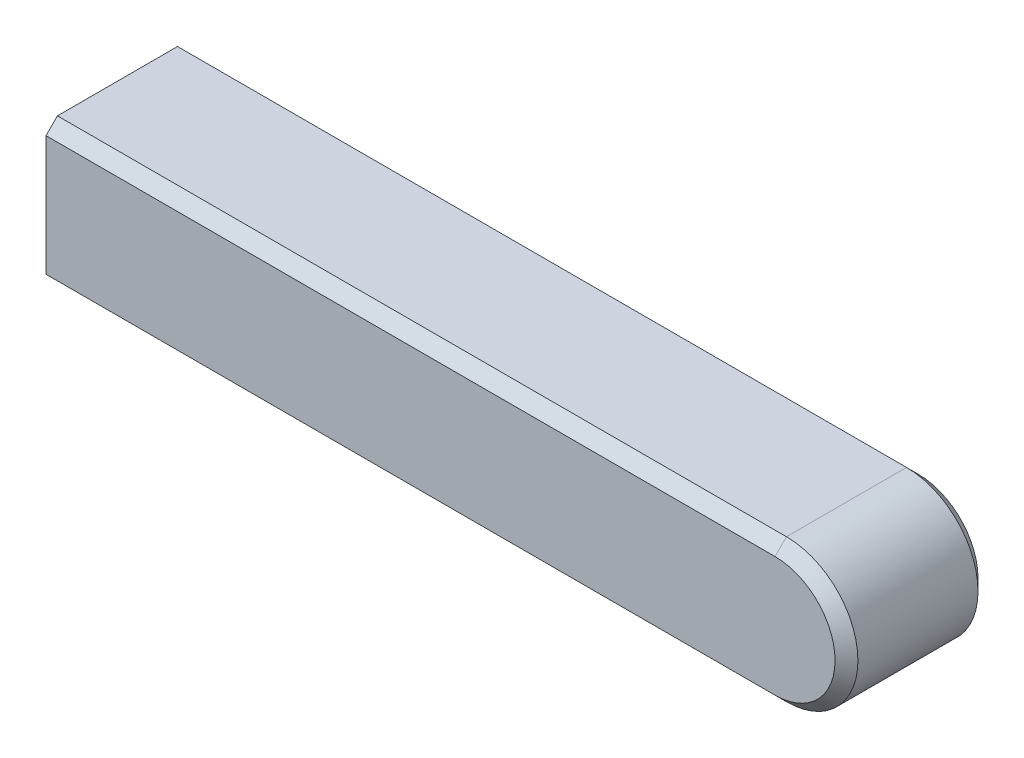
ISO-10303-21;
HEADER;
FILE_DESCRIPTION(('STEP AP214'),'2;1');
FILE_NAME('part.step','',(''),(''),'','','');
FILE_SCHEMA(('AUTOMOTIVE_DESIGN { 1 0 10303 214 1 1 1 1 }'));
ENDSEC;
DATA;
#1=APPLICATION_CONTEXT('core data for automotive mechanical design processes');
#2=APPLICATION_PROTOCOL_DEFINITION('international standard','automotive_design',2000,#1);
#3=PRODUCT_CONTEXT('',#1,'mechanical');
#4=PRODUCT('Part','Part','',(#3));
#5=PRODUCT_RELATED_PRODUCT_CATEGORY('part','',(#4));
#6=PRODUCT_DEFINITION_FORMATION('','',#4);
#7=PRODUCT_DEFINITION_CONTEXT('part definition',#1,'design');
#8=PRODUCT_DEFINITION('design','',#6,#7);
#9=PRODUCT_DEFINITION_SHAPE('','',#8);
#10=(LENGTH_UNIT() NAMED_UNIT(*) SI_UNIT(.MILLI.,.METRE.));
#11=(NAMED_UNIT(*) PLANE_ANGLE_UNIT() SI_UNIT($,.RADIAN.));
#12=(NAMED_UNIT(*) SI_UNIT($,.STERADIAN.) SOLID_ANGLE_UNIT());
#13=UNCERTAINTY_MEASURE_WITH_UNIT(LENGTH_MEASURE(1.E-05),#10,'distance_accuracy_value','');
#14=(GEOMETRIC_REPRESENTATION_CONTEXT(3) GLOBAL_UNCERTAINTY_ASSIGNED_CONTEXT((#13)) GLOBAL_UNIT_ASSIGNED_CONTEXT((#10,
#11,#12)) REPRESENTATION_CONTEXT('',''));
#15=CARTESIAN_POINT('',(0.,0.,0.));
#16=DIRECTION('',(0.,0.,1.));
#17=DIRECTION('',(1.,0.,0.));
#18=AXIS2_PLACEMENT_3D('',#15,#16,#17);
#19=CARTESIAN_POINT('',(33.6,-3.,0.4));
#20=DIRECTION('',(0.,-0.707106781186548,-0.707106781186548));
#21=DIRECTION('',(0.,0.707106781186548,-0.707106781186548));
#22=AXIS2_PLACEMENT_3D('',#19,#20,#21);
#23=PLANE('',#22);
#24=DIRECTION('',(1.,0.,0.));
#25=VECTOR('',#24,1.);
#26=CARTESIAN_POINT('',(0.,-3.,0.4));
#27=LINE('',#26,#25);
#28=CARTESIAN_POINT('',(0.,-3.,0.4));
#29=VERTEX_POINT('',#28);
#30=CARTESIAN_POINT('',(25.5,-3.00000000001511,0.400000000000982));
#31=VERTEX_POINT('',#30);
#32=EDGE_CURVE('E98',#29,#31,#27,.T.);
#33=ORIENTED_EDGE('',*,*,#32,.F.);
#34=DIRECTION('',(0.,0.707106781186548,-0.707106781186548));
#35=VECTOR('',#34,1.);
#36=CARTESIAN_POINT('',(0.,-3.,0.4));
#37=LINE('',#36,#35);
#38=CARTESIAN_POINT('',(0.,-2.6,0.));
#39=VERTEX_POINT('',#38);
#40=EDGE_CURVE('E70',#29,#39,#37,.T.);
#41=ORIENTED_EDGE('',*,*,#40,.T.);
#42=DIRECTION('',(1.,0.,0.));
#43=VECTOR('',#42,1.);
#44=CARTESIAN_POINT('',(0.,-2.6,0.));
#45=LINE('',#44,#43);
#46=CARTESIAN_POINT('',(25.5000001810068,-2.59999880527,0.));
#47=VERTEX_POINT('',#46);
#48=EDGE_CURVE('E46',#39,#47,#45,.T.);
#49=ORIENTED_EDGE('',*,*,#48,.T.);
#50=CARTESIAN_POINT('',(25.5,-3.00000000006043,0.400000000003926));
#51=CARTESIAN_POINT('',(25.5000000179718,-2.98333328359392,0.383333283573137));
#52=CARTESIAN_POINT('',(25.5000000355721,-2.96666656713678,0.366666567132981));
#53=CARTESIAN_POINT('',(25.5000000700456,-2.93333313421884,0.333333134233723));
#54=CARTESIAN_POINT('',(25.5000000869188,-2.91666641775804,0.31666641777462));
#55=CARTESIAN_POINT('',(25.5000001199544,-2.88333298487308,0.283332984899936));
#56=CARTESIAN_POINT('',(25.5000001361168,-2.86666626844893,0.266666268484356));
#57=CARTESIAN_POINT('',(25.5000001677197,-2.83333283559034,0.233332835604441));
#58=CARTESIAN_POINT('',(25.5000001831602,-2.81666611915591,0.216666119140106));
#59=CARTESIAN_POINT('',(25.5000002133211,-2.78333268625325,0.183332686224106));
#60=CARTESIAN_POINT('',(25.5000002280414,-2.76666596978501,0.16666596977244));
#61=CARTESIAN_POINT('',(25.5000002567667,-2.73333253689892,0.133332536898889));
#62=CARTESIAN_POINT('',(25.5000002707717,-2.71666582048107,0.116665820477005));
#63=CARTESIAN_POINT('',(25.5000002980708,-2.68333238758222,0.0833323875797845));
#64=CARTESIAN_POINT('',(25.5000003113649,-2.66666567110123,0.0666656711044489));
#65=CARTESIAN_POINT('',(25.500000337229,-2.63333223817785,0.0333322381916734));
#66=CARTESIAN_POINT('',(25.500000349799,-2.61666552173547,0.0166655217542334));
#67=CARTESIAN_POINT('',(25.5000003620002,-2.59999880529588,-1.19468599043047E-06));
#68=B_SPLINE_CURVE_WITH_KNOTS('',3,(#50,#51,#52,#53,#54,#55,#56,#57,#58,#59,#60,#61,#62,#63,#64,
#65,#66,#67),.UNSPECIFIED.,.F.,.F.,(4,2,2,2,2,2,2,2,4),(0.,0.0707108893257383,0.141421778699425,
0.212132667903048,0.282843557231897,0.35355444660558,0.424265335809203,0.494976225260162,
0.565687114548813),.UNSPECIFIED.);
#69=EDGE_CURVE('E57',#31,#47,#68,.T.);
#70=ORIENTED_EDGE('',*,*,#69,.F.);
#71=EDGE_LOOP('',(#33,#41,#49,#70));
#72=FACE_BOUND('',#71,.T.);
#73=ADVANCED_FACE('F16',(#72),#23,.T.);
#74=CARTESIAN_POINT('',(25.5000000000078,-0.500000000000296,0.400000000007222));
#75=DIRECTION('',(3.12634674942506E-12,-1.31831570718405E-12,1.));
#76=DIRECTION('',(1.,0.,-3.12634674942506E-12));
#77=AXIS2_PLACEMENT_3D('',#74,#75,#76);
#78=CONICAL_SURFACE('',#77,2.50000000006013,0.785398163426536);
#79=DIRECTION('',(0.,0.707106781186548,0.707106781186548));
#80=VECTOR('',#79,1.);
#81=CARTESIAN_POINT('',(25.5,2.,0.4));
#82=LINE('',#81,#80);
#83=CARTESIAN_POINT('',(25.5,2.,0.4));
#84=VERTEX_POINT('',#83);
#85=CARTESIAN_POINT('',(25.5000000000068,1.6,0.));
#86=VERTEX_POINT('',#85);
#87=EDGE_CURVE('E92',#84,#86,#82,.F.);
#88=ORIENTED_EDGE('',*,*,#87,.F.);
#89=CARTESIAN_POINT('',(25.5,-0.5,0.4));
#90=DIRECTION('',(0.,0.,1.));
#91=DIRECTION('',(1.,0.,0.));
#92=AXIS2_PLACEMENT_3D('',#89,#90,#91);
#93=CIRCLE('',#92,2.5);
#94=EDGE_CURVE('E175',#31,#84,#93,.T.);
#95=ORIENTED_EDGE('',*,*,#94,.F.);
#96=ORIENTED_EDGE('',*,*,#69,.T.);
#97=CARTESIAN_POINT('',(25.5000000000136,-0.500000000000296,0.));
#98=DIRECTION('',(0.,0.,1.));
#99=DIRECTION('',(1.,0.,0.));
#100=AXIS2_PLACEMENT_3D('',#97,#98,#99);
#101=CIRCLE('',#100,2.10000000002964);
#102=EDGE_CURVE('E19',#47,#86,#101,.T.);
#103=ORIENTED_EDGE('',*,*,#102,.T.);
#104=EDGE_LOOP('',(#88,#95,#96,#103));
#105=FACE_BOUND('',#104,.T.);
#106=ADVANCED_FACE('F214',(#105),#78,.T.);
#107=CARTESIAN_POINT('',(-5.6,2.,0.4));
#108=DIRECTION('',(0.,0.707106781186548,-0.707106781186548));
#109=DIRECTION('',(0.,0.707106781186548,0.707106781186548));
#110=AXIS2_PLACEMENT_3D('',#107,#108,#109);
#111=PLANE('',#110);
#112=DIRECTION('',(1.,0.,0.));
#113=VECTOR('',#112,1.);
#114=CARTESIAN_POINT('',(0.,1.6,0.));
#115=LINE('',#114,#113);
#116=CARTESIAN_POINT('',(0.,1.6,0.));
#117=VERTEX_POINT('',#116);
#118=EDGE_CURVE('E95',#86,#117,#115,.F.);
#119=ORIENTED_EDGE('',*,*,#118,.T.);
#120=DIRECTION('',(0.,0.707106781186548,0.707106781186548));
#121=VECTOR('',#120,1.);
#122=CARTESIAN_POINT('',(0.,2.,0.4));
#123=LINE('',#122,#121);
#124=CARTESIAN_POINT('',(0.,2.,0.4));
#125=VERTEX_POINT('',#124);
#126=EDGE_CURVE('E78',#117,#125,#123,.T.);
#127=ORIENTED_EDGE('',*,*,#126,.T.);
#128=DIRECTION('',(1.,0.,0.));
#129=VECTOR('',#128,1.);
#130=CARTESIAN_POINT('',(25.5,2.,0.4));
#131=LINE('',#130,#129);
#132=EDGE_CURVE('E102',#84,#125,#131,.F.);
#133=ORIENTED_EDGE('',*,*,#132,.F.);
#134=ORIENTED_EDGE('',*,*,#87,.T.);
#135=EDGE_LOOP('',(#119,#127,#133,#134));
#136=FACE_BOUND('',#135,.T.);
#137=ADVANCED_FACE('F96',(#136),#111,.T.);
#138=CARTESIAN_POINT('',(0.,0.,0.));
#139=DIRECTION('',(0.,0.,1.));
#140=DIRECTION('',(1.,0.,0.));
#141=AXIS2_PLACEMENT_3D('',#138,#139,#140);
#142=PLANE('',#141);
#143=ORIENTED_EDGE('',*,*,#102,.F.);
#144=ORIENTED_EDGE('',*,*,#48,.F.);
#145=DIRECTION('',(0.,1.,0.));
#146=VECTOR('',#145,1.);
#147=CARTESIAN_POINT('',(0.,2.,0.));
#148=LINE('',#147,#146);
#149=EDGE_CURVE('E88',#117,#39,#148,.F.);
#150=ORIENTED_EDGE('',*,*,#149,.F.);
#151=ORIENTED_EDGE('',*,*,#118,.F.);
#152=EDGE_LOOP('',(#143,#144,#150,#151));
#153=FACE_BOUND('',#152,.T.);
#154=ADVANCED_FACE('F100',(#153),#142,.F.);
#155=CARTESIAN_POINT('',(0.,-3.,0.));
#156=DIRECTION('',(0.,-1.,0.));
#157=DIRECTION('',(0.,0.,-1.));
#158=AXIS2_PLACEMENT_3D('',#155,#156,#157);
#159=PLANE('',#158);
#160=DIRECTION('',(0.,0.,1.));
#161=VECTOR('',#160,1.);
#162=CARTESIAN_POINT('',(0.,-3.,0.));
#163=LINE('',#162,#161);
#164=CARTESIAN_POINT('',(0.,-3.,4.6));
#165=VERTEX_POINT('',#164);
#166=EDGE_CURVE('E101',#29,#165,#163,.T.);
#167=ORIENTED_EDGE('',*,*,#166,.F.);
#168=ORIENTED_EDGE('',*,*,#32,.T.);
#169=DIRECTION('',(0.,0.,1.));
#170=VECTOR('',#169,1.);
#171=CARTESIAN_POINT('',(25.5,-3.,2.5));
#172=LINE('',#171,#170);
#173=CARTESIAN_POINT('',(25.5000000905,-3.00000000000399,4.60000000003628));
#174=VERTEX_POINT('',#173);
#175=EDGE_CURVE('E178',#174,#31,#172,.F.);
#176=ORIENTED_EDGE('',*,*,#175,.F.);
#177=DIRECTION('',(1.,0.,0.));
#178=VECTOR('',#177,1.);
#179=CARTESIAN_POINT('',(33.6,-3.,4.6));
#180=LINE('',#179,#178);
#181=EDGE_CURVE('E159',#174,#165,#180,.F.);
#182=ORIENTED_EDGE('',*,*,#181,.T.);
#183=EDGE_LOOP('',(#167,#168,#176,#182));
#184=FACE_BOUND('',#183,.T.);
#185=ADVANCED_FACE('F232',(#184),#159,.T.);
#186=CARTESIAN_POINT('',(25.5,-0.5,2.5));
#187=DIRECTION('',(0.,0.,1.));
#188=DIRECTION('',(1.,0.,0.));
#189=AXIS2_PLACEMENT_3D('',#186,#187,#188);
#190=CYLINDRICAL_SURFACE('',#189,2.5);
#191=ORIENTED_EDGE('',*,*,#175,.T.);
#192=ORIENTED_EDGE('',*,*,#94,.T.);
#193=DIRECTION('',(0.,0.,1.));
#194=VECTOR('',#193,1.);
#195=CARTESIAN_POINT('',(25.5,2.,0.));
#196=LINE('',#195,#194);
#197=CARTESIAN_POINT('',(25.5,2.00000000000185,4.60000000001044));
#198=VERTEX_POINT('',#197);
#199=EDGE_CURVE('E105',#198,#84,#196,.F.);
#200=ORIENTED_EDGE('',*,*,#199,.F.);
#201=CARTESIAN_POINT('',(25.5000000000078,-0.500000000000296,4.60000000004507));
#202=DIRECTION('',(3.12638803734E-12,-1.31838984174E-12,-1.));
#203=DIRECTION('',(-0.385834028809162,0.922568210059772,-2.42236786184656E-12));
#204=AXIS2_PLACEMENT_3D('',#201,#202,#203);
#205=CIRCLE('',#204,2.50000000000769);
#206=EDGE_CURVE('E167',#174,#198,#205,.F.);
#207=ORIENTED_EDGE('',*,*,#206,.F.);
#208=EDGE_LOOP('',(#191,#192,#200,#207));
#209=FACE_BOUND('',#208,.T.);
#210=ADVANCED_FACE('F227',(#209),#190,.T.);
#211=CARTESIAN_POINT('',(25.5,2.,0.));
#212=DIRECTION('',(0.,1.,0.));
#213=DIRECTION('',(0.,0.,1.));
#214=AXIS2_PLACEMENT_3D('',#211,#212,#213);
#215=PLANE('',#214);
#216=ORIENTED_EDGE('',*,*,#199,.T.);
#217=ORIENTED_EDGE('',*,*,#132,.T.);
#218=DIRECTION('',(0.,0.,1.));
#219=VECTOR('',#218,1.);
#220=CARTESIAN_POINT('',(0.,2.,0.));
#221=LINE('',#220,#219);
#222=CARTESIAN_POINT('',(0.,2.,4.6));
#223=VERTEX_POINT('',#222);
#224=EDGE_CURVE('E91',#223,#125,#221,.F.);
#225=ORIENTED_EDGE('',*,*,#224,.F.);
#226=DIRECTION('',(1.,0.,0.));
#227=VECTOR('',#226,1.);
#228=CARTESIAN_POINT('',(-5.6,2.,4.6));
#229=LINE('',#228,#227);
#230=EDGE_CURVE('E128',#223,#198,#229,.T.);
#231=ORIENTED_EDGE('',*,*,#230,.T.);
#232=EDGE_LOOP('',(#216,#217,#225,#231));
#233=FACE_BOUND('',#232,.T.);
#234=ADVANCED_FACE('F246',(#233),#215,.T.);
#235=CARTESIAN_POINT('',(0.,2.,0.));
#236=DIRECTION('',(-1.,0.,0.));
#237=DIRECTION('',(0.,0.,1.));
#238=AXIS2_PLACEMENT_3D('',#235,#236,#237);
#239=PLANE('',#238);
#240=ORIENTED_EDGE('',*,*,#224,.T.);
#241=ORIENTED_EDGE('',*,*,#126,.F.);
#242=ORIENTED_EDGE('',*,*,#149,.T.);
#243=ORIENTED_EDGE('',*,*,#40,.F.);
#244=ORIENTED_EDGE('',*,*,#166,.T.);
#245=DIRECTION('',(0.,0.707106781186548,0.707106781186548));
#246=VECTOR('',#245,1.);
#247=CARTESIAN_POINT('',(0.,-3.,4.6));
#248=LINE('',#247,#246);
#249=CARTESIAN_POINT('',(0.,-2.6,5.));
#250=VERTEX_POINT('',#249);
#251=EDGE_CURVE('E151',#165,#250,#248,.T.);
#252=ORIENTED_EDGE('',*,*,#251,.T.);
#253=DIRECTION('',(0.,1.,0.));
#254=VECTOR('',#253,1.);
#255=CARTESIAN_POINT('',(0.,0.,5.));
#256=LINE('',#255,#254);
#257=CARTESIAN_POINT('',(0.,1.6,5.));
#258=VERTEX_POINT('',#257);
#259=EDGE_CURVE('E116',#258,#250,#256,.F.);
#260=ORIENTED_EDGE('',*,*,#259,.F.);
#261=DIRECTION('',(0.,0.707106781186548,-0.707106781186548));
#262=VECTOR('',#261,1.);
#263=CARTESIAN_POINT('',(0.,2.,4.6));
#264=LINE('',#263,#262);
#265=EDGE_CURVE('E120',#258,#223,#264,.T.);
#266=ORIENTED_EDGE('',*,*,#265,.T.);
#267=EDGE_LOOP('',(#240,#241,#242,#243,#244,#252,#260,#266));
#268=FACE_BOUND('',#267,.T.);
#269=ADVANCED_FACE('F86',(#268),#239,.T.);
#270=CARTESIAN_POINT('',(33.6,-3.,4.6));
#271=DIRECTION('',(0.,0.707106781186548,-0.707106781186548));
#272=DIRECTION('',(0.,0.707106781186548,0.707106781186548));
#273=AXIS2_PLACEMENT_3D('',#270,#271,#272);
#274=PLANE('',#273);
#275=ORIENTED_EDGE('',*,*,#181,.F.);
#276=CARTESIAN_POINT('',(25.5000003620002,-2.59999880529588,5.00000119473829));
#277=CARTESIAN_POINT('',(25.5000003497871,-2.61666552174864,4.98333447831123));
#278=CARTESIAN_POINT('',(25.50000033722,-2.63333223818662,4.96666776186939));
#279=CARTESIAN_POINT('',(25.5000003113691,-2.66666567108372,4.93333432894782));
#280=CARTESIAN_POINT('',(25.5000002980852,-2.68333238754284,4.91666761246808));
#281=CARTESIAN_POINT('',(25.5000002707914,-2.71666582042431,4.88333417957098));
#282=CARTESIAN_POINT('',(25.5000002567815,-2.73333253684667,4.8666674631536));
#283=CARTESIAN_POINT('',(25.5000002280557,-2.76666596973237,4.83333403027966));
#284=CARTESIAN_POINT('',(25.5000002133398,-2.78333268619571,4.8166673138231));
#285=CARTESIAN_POINT('',(25.5000001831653,-2.81666611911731,4.78333388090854));
#286=CARTESIAN_POINT('',(25.5000001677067,-2.83333283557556,4.76666716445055));
#287=CARTESIAN_POINT('',(25.5000001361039,-2.86666626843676,4.7333337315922));
#288=CARTESIAN_POINT('',(25.5000001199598,-2.8833329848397,4.71666701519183));
#289=CARTESIAN_POINT('',(25.5000000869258,-2.91666641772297,4.68333358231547));
#290=CARTESIAN_POINT('',(25.500000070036,-2.9333331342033,4.66666686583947));
#291=CARTESIAN_POINT('',(25.500000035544,-2.96666656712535,4.63333343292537));
#292=CARTESIAN_POINT('',(25.5000000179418,-2.98333328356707,4.61666671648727));
#293=CARTESIAN_POINT('',(25.5,-3.00000000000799,4.60000000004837));
#294=B_SPLINE_CURVE_WITH_KNOTS('',3,(#276,#277,#278,#279,#280,#281,#282,#283,#284,#285,#286,
#287,#288,#289,#290,#291,#292,#293),.UNSPECIFIED.,.F.,.F.,(4,2,2,2,2,2,2,2,4),(0.,
0.0707108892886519,0.14142177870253,0.212132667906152,0.282843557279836,0.353554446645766,
0.424265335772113,0.494976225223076,0.565687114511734),.UNSPECIFIED.);
#295=CARTESIAN_POINT('',(25.5000001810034,-2.59999940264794,5.00000059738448));
#296=VERTEX_POINT('',#295);
#297=EDGE_CURVE('E138',#296,#174,#294,.T.);
#298=ORIENTED_EDGE('',*,*,#297,.F.);
#299=DIRECTION('',(1.,0.,0.));
#300=VECTOR('',#299,1.);
#301=CARTESIAN_POINT('',(0.,-2.6,5.));
#302=LINE('',#301,#300);
#303=EDGE_CURVE('E113',#250,#296,#302,.T.);
#304=ORIENTED_EDGE('',*,*,#303,.F.);
#305=ORIENTED_EDGE('',*,*,#251,.F.);
#306=EDGE_LOOP('',(#275,#298,#304,#305));
#307=FACE_BOUND('',#306,.T.);
#308=ADVANCED_FACE('F236',(#307),#274,.F.);
#309=CARTESIAN_POINT('',(25.5000000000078,-0.500000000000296,4.60000000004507));
#310=DIRECTION('',(3.12644768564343E-12,-1.31833225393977E-12,-1.));
#311=DIRECTION('',(-1.,0.,-3.12644768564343E-12));
#312=AXIS2_PLACEMENT_3D('',#309,#310,#311);
#313=CONICAL_SURFACE('',#312,2.50000000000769,0.785398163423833);
#314=DIRECTION('',(0.,0.707106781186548,-0.707106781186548));
#315=VECTOR('',#314,1.);
#316=CARTESIAN_POINT('',(25.5,2.,4.6));
#317=LINE('',#316,#315);
#318=CARTESIAN_POINT('',(25.5,1.59999999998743,5.00000000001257));
#319=VERTEX_POINT('',#318);
#320=EDGE_CURVE('E34',#198,#319,#317,.F.);
#321=ORIENTED_EDGE('',*,*,#320,.T.);
#322=CARTESIAN_POINT('',(25.5000000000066,-0.499999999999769,5.0000000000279));
#323=DIRECTION('',(3.12644768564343E-12,-1.31833225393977E-12,-1.));
#324=DIRECTION('',(-1.,0.,-3.12644768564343E-12));
#325=AXIS2_PLACEMENT_3D('',#322,#323,#324);
#326=CIRCLE('',#325,2.10000000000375);
#327=EDGE_CURVE('E25',#296,#319,#326,.F.);
#328=ORIENTED_EDGE('',*,*,#327,.F.);
#329=ORIENTED_EDGE('',*,*,#297,.T.);
#330=ORIENTED_EDGE('',*,*,#206,.T.);
#331=EDGE_LOOP('',(#321,#328,#329,#330));
#332=FACE_BOUND('',#331,.T.);
#333=ADVANCED_FACE('F146',(#332),#313,.T.);
#334=CARTESIAN_POINT('',(-5.6,2.,4.6));
#335=DIRECTION('',(0.,-0.707106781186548,-0.707106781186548));
#336=DIRECTION('',(0.,0.707106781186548,-0.707106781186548));
#337=AXIS2_PLACEMENT_3D('',#334,#335,#336);
#338=PLANE('',#337);
#339=DIRECTION('',(1.,0.,0.));
#340=VECTOR('',#339,1.);
#341=CARTESIAN_POINT('',(0.,1.6,5.));
#342=LINE('',#341,#340);
#343=EDGE_CURVE('E11',#319,#258,#342,.F.);
#344=ORIENTED_EDGE('',*,*,#343,.F.);
#345=ORIENTED_EDGE('',*,*,#320,.F.);
#346=ORIENTED_EDGE('',*,*,#230,.F.);
#347=ORIENTED_EDGE('',*,*,#265,.F.);
#348=EDGE_LOOP('',(#344,#345,#346,#347));
#349=FACE_BOUND('',#348,.T.);
#350=ADVANCED_FACE('F144',(#349),#338,.F.);
#351=CARTESIAN_POINT('',(0.,0.,5.));
#352=DIRECTION('',(0.,0.,1.));
#353=DIRECTION('',(1.,0.,0.));
#354=AXIS2_PLACEMENT_3D('',#351,#352,#353);
#355=PLANE('',#354);
#356=ORIENTED_EDGE('',*,*,#327,.T.);
#357=ORIENTED_EDGE('',*,*,#343,.T.);
#358=ORIENTED_EDGE('',*,*,#259,.T.);
#359=ORIENTED_EDGE('',*,*,#303,.T.);
#360=EDGE_LOOP('',(#356,#357,#358,#359));
#361=FACE_BOUND('',#360,.T.);
#362=ADVANCED_FACE('F248',(#361),#355,.T.);
#363=CLOSED_SHELL('',(#73,#106,#137,#154,#185,#210,#234,#269,#308,#333,#350,#362));
#364=MANIFOLD_SOLID_BREP('B1',#363);
#365=ADVANCED_BREP_SHAPE_REPRESENTATION('',(#18,#364),#14);
#366=SHAPE_DEFINITION_REPRESENTATION(#9,#365);
ENDSEC;
END-ISO-10303-21;
